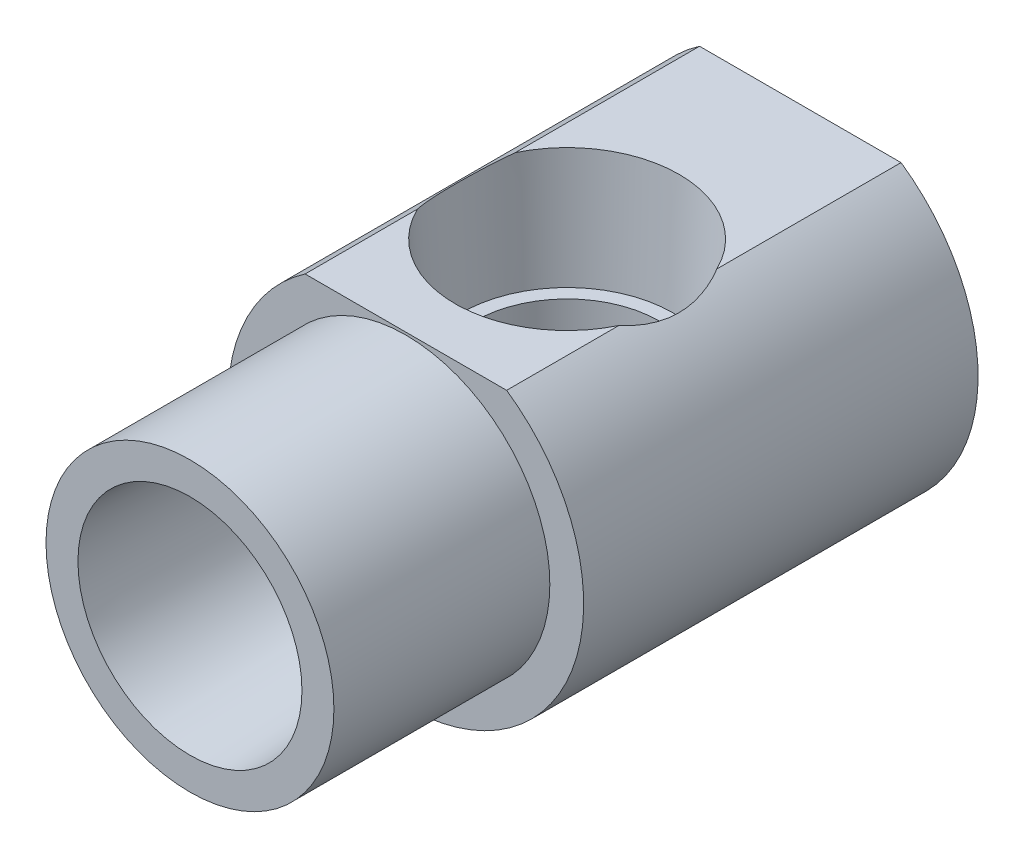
ISO-10303-21;
HEADER;
FILE_DESCRIPTION(('STEP AP214'),'2;1');
FILE_NAME('part.step','',(''),(''),'','','');
FILE_SCHEMA(('AUTOMOTIVE_DESIGN { 1 0 10303 214 1 1 1 1 }'));
ENDSEC;
DATA;
#1=APPLICATION_CONTEXT('core data for automotive mechanical design processes');
#2=APPLICATION_PROTOCOL_DEFINITION('international standard','automotive_design',2000,#1);
#3=PRODUCT_CONTEXT('',#1,'mechanical');
#4=PRODUCT('Part','Part','',(#3));
#5=PRODUCT_RELATED_PRODUCT_CATEGORY('part','',(#4));
#6=PRODUCT_DEFINITION_FORMATION('','',#4);
#7=PRODUCT_DEFINITION_CONTEXT('part definition',#1,'design');
#8=PRODUCT_DEFINITION('design','',#6,#7);
#9=PRODUCT_DEFINITION_SHAPE('','',#8);
#10=(LENGTH_UNIT() NAMED_UNIT(*) SI_UNIT(.MILLI.,.METRE.));
#11=(NAMED_UNIT(*) PLANE_ANGLE_UNIT() SI_UNIT($,.RADIAN.));
#12=(NAMED_UNIT(*) SI_UNIT($,.STERADIAN.) SOLID_ANGLE_UNIT());
#13=UNCERTAINTY_MEASURE_WITH_UNIT(LENGTH_MEASURE(1.E-05),#10,'distance_accuracy_value','');
#14=(GEOMETRIC_REPRESENTATION_CONTEXT(3) GLOBAL_UNCERTAINTY_ASSIGNED_CONTEXT((#13)) GLOBAL_UNIT_ASSIGNED_CONTEXT((#10,
#11,#12)) REPRESENTATION_CONTEXT('',''));
#15=CARTESIAN_POINT('',(0.,0.,0.));
#16=DIRECTION('',(0.,0.,1.));
#17=DIRECTION('',(1.,0.,0.));
#18=AXIS2_PLACEMENT_3D('',#15,#16,#17);
#19=CARTESIAN_POINT('',(-8.89,12.9217429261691,0.));
#20=DIRECTION('',(0.,-1.,0.));
#21=DIRECTION('',(0.,0.,-1.));
#22=AXIS2_PLACEMENT_3D('',#19,#20,#21);
#23=PLANE('',#22);
#24=DIRECTION('',(0.,0.,-1.));
#25=VECTOR('',#24,1.);
#26=CARTESIAN_POINT('',(8.89,12.9217429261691,0.));
#27=LINE('',#26,#25);
#28=CARTESIAN_POINT('',(8.89,12.9217429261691,-19.05));
#29=VERTEX_POINT('',#28);
#30=CARTESIAN_POINT('',(8.89,12.9217429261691,-28.9480549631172));
#31=VERTEX_POINT('',#30);
#32=EDGE_CURVE('E99',#29,#31,#27,.T.);
#33=ORIENTED_EDGE('',*,*,#32,.T.);
#34=CARTESIAN_POINT('',(0.,12.9217429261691,-33.274));
#35=DIRECTION('',(0.,-1.,0.));
#36=DIRECTION('',(0.,0.,-1.));
#37=AXIS2_PLACEMENT_3D('',#34,#35,#36);
#38=CIRCLE('',#37,9.88665264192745);
#39=CARTESIAN_POINT('',(-8.89,12.9217429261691,-28.9480549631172));
#40=VERTEX_POINT('',#39);
#41=EDGE_CURVE('E219',#31,#40,#38,.T.);
#42=ORIENTED_EDGE('',*,*,#41,.T.);
#43=DIRECTION('',(0.,0.,-1.));
#44=VECTOR('',#43,1.);
#45=CARTESIAN_POINT('',(-8.89,12.9217429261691,0.));
#46=LINE('',#45,#44);
#47=CARTESIAN_POINT('',(-8.89,12.9217429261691,-19.05));
#48=VERTEX_POINT('',#47);
#49=EDGE_CURVE('E115',#48,#40,#46,.T.);
#50=ORIENTED_EDGE('',*,*,#49,.F.);
#51=DIRECTION('',(1.,0.,0.));
#52=VECTOR('',#51,1.);
#53=CARTESIAN_POINT('',(-12.7,12.9217429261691,-19.05));
#54=LINE('',#53,#52);
#55=EDGE_CURVE('E104',#48,#29,#54,.T.);
#56=ORIENTED_EDGE('',*,*,#55,.T.);
#57=EDGE_LOOP('',(#33,#42,#50,#56));
#58=FACE_BOUND('',#57,.T.);
#59=ADVANCED_FACE('F16',(#58),#23,.F.);
#60=CARTESIAN_POINT('',(-8.73125000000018,0.,-17.0777962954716));
#61=DIRECTION('',(0.,0.,1.));
#62=DIRECTION('',(1.,0.,0.));
#63=AXIS2_PLACEMENT_3D('',#60,#61,#62);
#64=PLANE('',#63);
#65=CARTESIAN_POINT('',(0.,-1.53831558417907,-17.0777962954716));
#66=DIRECTION('',(0.,0.,1.));
#67=DIRECTION('',(0.,1.,0.));
#68=AXIS2_PLACEMENT_3D('',#65,#66,#67);
#69=ELLIPSE('',#68,7.0682508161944,6.80767250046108);
#70=CARTESIAN_POINT('',(0.,5.52993523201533,-17.0777962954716));
#71=VERTEX_POINT('',#70);
#72=EDGE_CURVE('E118',#71,#71,#69,.F.);
#73=ORIENTED_EDGE('',*,*,#72,.T.);
#74=EDGE_LOOP('',(#73));
#75=FACE_BOUND('',#74,.T.);
#76=CARTESIAN_POINT('',(0.,0.,-17.0777962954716));
#77=DIRECTION('',(0.,0.,1.));
#78=DIRECTION('',(1.,0.,0.));
#79=AXIS2_PLACEMENT_3D('',#76,#77,#78);
#80=CIRCLE('',#79,8.98559062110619);
#81=CARTESIAN_POINT('',(8.98559062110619,0.,-17.0777962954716));
#82=VERTEX_POINT('',#81);
#83=EDGE_CURVE('E217',#82,#82,#80,.T.);
#84=ORIENTED_EDGE('',*,*,#83,.T.);
#85=EDGE_LOOP('',(#84));
#86=FACE_BOUND('',#85,.T.);
#87=ADVANCED_FACE('F167',(#75,#86),#64,.T.);
#88=CARTESIAN_POINT('',(-8.73125000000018,0.,0.));
#89=DIRECTION('',(0.,0.,1.));
#90=DIRECTION('',(1.,0.,0.));
#91=AXIS2_PLACEMENT_3D('',#88,#89,#90);
#92=PLANE('',#91);
#93=CARTESIAN_POINT('',(0.,0.,0.));
#94=DIRECTION('',(0.,0.,1.));
#95=DIRECTION('',(1.,0.,0.));
#96=AXIS2_PLACEMENT_3D('',#93,#94,#95);
#97=CIRCLE('',#96,9.8806);
#98=CARTESIAN_POINT('',(9.8806,0.,0.));
#99=VERTEX_POINT('',#98);
#100=EDGE_CURVE('E222',#99,#99,#97,.T.);
#101=ORIENTED_EDGE('',*,*,#100,.F.);
#102=EDGE_LOOP('',(#101));
#103=FACE_BOUND('',#102,.T.);
#104=CARTESIAN_POINT('',(0.,0.,0.));
#105=DIRECTION('',(0.,0.,1.));
#106=DIRECTION('',(1.,0.,0.));
#107=AXIS2_PLACEMENT_3D('',#104,#105,#106);
#108=CIRCLE('',#107,12.7);
#109=CARTESIAN_POINT('',(12.7,0.,0.));
#110=VERTEX_POINT('',#109);
#111=EDGE_CURVE('E215',#110,#110,#108,.F.);
#112=ORIENTED_EDGE('',*,*,#111,.F.);
#113=EDGE_LOOP('',(#112));
#114=FACE_BOUND('',#113,.T.);
#115=ADVANCED_FACE('F171',(#103,#114),#92,.T.);
#116=CARTESIAN_POINT('',(-15.6845,0.,-53.848));
#117=DIRECTION('',(0.,0.,-1.));
#118=DIRECTION('',(-1.,0.,0.));
#119=AXIS2_PLACEMENT_3D('',#116,#117,#118);
#120=PLANE('',#119);
#121=DIRECTION('',(1.,0.,0.));
#122=VECTOR('',#121,1.);
#123=CARTESIAN_POINT('',(-3.66617420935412,6.35,-53.848));
#124=LINE('',#123,#122);
#125=CARTESIAN_POINT('',(-3.66617420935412,6.35,-53.848));
#126=VERTEX_POINT('',#125);
#127=CARTESIAN_POINT('',(3.66617420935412,6.35,-53.848));
#128=VERTEX_POINT('',#127);
#129=EDGE_CURVE('E121',#126,#128,#124,.T.);
#130=ORIENTED_EDGE('',*,*,#129,.F.);
#131=DIRECTION('',(0.5,0.866025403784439,0.));
#132=VECTOR('',#131,1.);
#133=CARTESIAN_POINT('',(-7.33234841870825,0.,-53.848));
#134=LINE('',#133,#132);
#135=CARTESIAN_POINT('',(-7.33234841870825,0.,-53.848));
#136=VERTEX_POINT('',#135);
#137=EDGE_CURVE('E274',#136,#126,#134,.T.);
#138=ORIENTED_EDGE('',*,*,#137,.F.);
#139=DIRECTION('',(-0.5,0.866025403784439,0.));
#140=VECTOR('',#139,1.);
#141=CARTESIAN_POINT('',(-3.66617420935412,-6.35,-53.848));
#142=LINE('',#141,#140);
#143=CARTESIAN_POINT('',(-3.66617420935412,-6.35,-53.848));
#144=VERTEX_POINT('',#143);
#145=EDGE_CURVE('E300',#144,#136,#142,.T.);
#146=ORIENTED_EDGE('',*,*,#145,.F.);
#147=DIRECTION('',(-1.,0.,0.));
#148=VECTOR('',#147,1.);
#149=CARTESIAN_POINT('',(3.66617420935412,-6.35,-53.848));
#150=LINE('',#149,#148);
#151=CARTESIAN_POINT('',(3.66617420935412,-6.35,-53.848));
#152=VERTEX_POINT('',#151);
#153=EDGE_CURVE('E297',#152,#144,#150,.T.);
#154=ORIENTED_EDGE('',*,*,#153,.F.);
#155=DIRECTION('',(-0.5,-0.866025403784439,0.));
#156=VECTOR('',#155,1.);
#157=CARTESIAN_POINT('',(7.33234841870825,0.,-53.848));
#158=LINE('',#157,#156);
#159=CARTESIAN_POINT('',(7.33234841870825,0.,-53.848));
#160=VERTEX_POINT('',#159);
#161=EDGE_CURVE('E294',#160,#152,#158,.T.);
#162=ORIENTED_EDGE('',*,*,#161,.F.);
#163=DIRECTION('',(0.5,-0.866025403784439,0.));
#164=VECTOR('',#163,1.);
#165=CARTESIAN_POINT('',(3.66617420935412,6.35,-53.848));
#166=LINE('',#165,#164);
#167=EDGE_CURVE('E291',#128,#160,#166,.T.);
#168=ORIENTED_EDGE('',*,*,#167,.F.);
#169=EDGE_LOOP('',(#130,#138,#146,#154,#162,#168));
#170=FACE_BOUND('',#169,.T.);
#171=DIRECTION('',(-1.,0.,0.));
#172=VECTOR('',#171,1.);
#173=CARTESIAN_POINT('',(-8.89,12.9217429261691,-53.848));
#174=LINE('',#173,#172);
#175=CARTESIAN_POINT('',(8.89,12.9217429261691,-53.848));
#176=VERTEX_POINT('',#175);
#177=CARTESIAN_POINT('',(-8.89,12.9217429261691,-53.848));
#178=VERTEX_POINT('',#177);
#179=EDGE_CURVE('E96',#176,#178,#174,.T.);
#180=ORIENTED_EDGE('',*,*,#179,.F.);
#181=CARTESIAN_POINT('',(0.,0.,-53.848));
#182=DIRECTION('',(0.,0.,-1.));
#183=DIRECTION('',(-1.,0.,0.));
#184=AXIS2_PLACEMENT_3D('',#181,#182,#183);
#185=CIRCLE('',#184,15.6845);
#186=EDGE_CURVE('E20',#176,#178,#185,.T.);
#187=ORIENTED_EDGE('',*,*,#186,.T.);
#188=EDGE_LOOP('',(#180,#187));
#189=FACE_BOUND('',#188,.T.);
#190=ADVANCED_FACE('F18',(#170,#189),#120,.T.);
#191=CARTESIAN_POINT('',(0.,0.,-75.1971669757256));
#192=DIRECTION('',(0.,0.,-1.));
#193=DIRECTION('',(-1.,0.,0.));
#194=AXIS2_PLACEMENT_3D('',#191,#192,#193);
#195=CYLINDRICAL_SURFACE('',#194,15.6845);
#196=CARTESIAN_POINT('',(6.18126199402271,14.4151149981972,-25.4578903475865));
#197=CARTESIAN_POINT('',(6.40820210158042,14.317827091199,-25.6438923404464));
#198=CARTESIAN_POINT('',(6.62617183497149,14.2179923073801,-25.8394298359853));
#199=CARTESIAN_POINT('',(7.04356392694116,14.015896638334,-26.248561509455));
#200=CARTESIAN_POINT('',(7.24297338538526,13.9136341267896,-26.4621680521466));
#201=CARTESIAN_POINT('',(7.62085258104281,13.7102837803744,-26.9044425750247));
#202=CARTESIAN_POINT('',(7.79947267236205,13.6091929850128,-27.1329809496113));
#203=CARTESIAN_POINT('',(8.13667540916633,13.4103063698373,-27.605534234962));
#204=CARTESIAN_POINT('',(8.29527210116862,13.3125082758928,-27.8495381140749));
#205=CARTESIAN_POINT('',(8.52405372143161,13.166366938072,-28.237604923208));
#206=CARTESIAN_POINT('',(8.6015950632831,13.1157948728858,-28.3765443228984));
#207=CARTESIAN_POINT('',(8.75042416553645,13.0169736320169,-28.6587897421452));
#208=CARTESIAN_POINT('',(8.82170394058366,12.9687274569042,-28.8021010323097));
#209=CARTESIAN_POINT('',(8.98942344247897,12.85334420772,-29.160530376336));
#210=CARTESIAN_POINT('',(9.082097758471,12.7878879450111,-29.377972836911));
#211=CARTESIAN_POINT('',(9.25265845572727,12.6650269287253,-29.8207919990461));
#212=CARTESIAN_POINT('',(9.33054529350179,12.6076219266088,-30.046168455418));
#213=CARTESIAN_POINT('',(9.47086217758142,12.5025600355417,-30.5041364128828));
#214=CARTESIAN_POINT('',(9.5332799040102,12.4549109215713,-30.7367334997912));
#215=CARTESIAN_POINT('',(9.64181076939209,12.3710847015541,-31.2076218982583));
#216=CARTESIAN_POINT('',(9.68793245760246,12.3349015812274,-31.445910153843));
#217=CARTESIAN_POINT('',(9.76349281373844,12.2751820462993,-31.9282043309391));
#218=CARTESIAN_POINT('',(9.79282896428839,12.2517233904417,-32.1722361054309));
#219=CARTESIAN_POINT('',(9.83390591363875,12.2187780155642,-32.662731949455));
#220=CARTESIAN_POINT('',(9.84564637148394,12.2092915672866,-32.9091960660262));
#221=CARTESIAN_POINT('',(9.85132494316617,12.2047101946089,-33.4024609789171));
#222=CARTESIAN_POINT('',(9.84526326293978,12.2096151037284,-33.6492617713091));
#223=CARTESIAN_POINT('',(9.81544491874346,12.233598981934,-34.1410778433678));
#224=CARTESIAN_POINT('',(9.79168936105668,12.2526770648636,-34.386093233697));
#225=CARTESIAN_POINT('',(9.7294701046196,12.3021291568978,-34.8530070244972));
#226=CARTESIAN_POINT('',(9.69232783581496,12.3314830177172,-35.0751929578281));
#227=CARTESIAN_POINT('',(9.60385268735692,12.400512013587,-35.5151815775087));
#228=CARTESIAN_POINT('',(9.55251354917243,12.4401917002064,-35.7329822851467));
#229=CARTESIAN_POINT('',(9.43631194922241,12.5285621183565,-36.1626605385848));
#230=CARTESIAN_POINT('',(9.37147123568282,12.5772383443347,-36.3745469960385));
#231=CARTESIAN_POINT('',(9.22879623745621,12.6822986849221,-36.7919366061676));
#232=CARTESIAN_POINT('',(9.15096192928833,12.7386828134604,-36.9974397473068));
#233=CARTESIAN_POINT('',(9.01061877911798,12.838109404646,-37.3347261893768));
#234=CARTESIAN_POINT('',(8.95152353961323,12.8794177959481,-37.4684665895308));
#235=CARTESIAN_POINT('',(8.76461266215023,13.0080031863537,-37.8679033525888));
#236=CARTESIAN_POINT('',(8.62838014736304,13.0990466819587,-38.1285210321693));
#237=CARTESIAN_POINT('',(8.33484719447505,13.2877507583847,-38.6351224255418));
#238=CARTESIAN_POINT('',(8.17753852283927,13.3854139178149,-38.8811003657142));
#239=CARTESIAN_POINT('',(7.8423843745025,13.5844995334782,-39.3580815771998));
#240=CARTESIAN_POINT('',(7.66448703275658,13.685931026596,-39.5890446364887));
#241=CARTESIAN_POINT('',(7.28939666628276,13.8893391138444,-40.034214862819));
#242=CARTESIAN_POINT('',(7.09221474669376,13.9913153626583,-40.2484315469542));
#243=CARTESIAN_POINT('',(6.68803601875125,14.1888008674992,-40.6503950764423));
#244=CARTESIAN_POINT('',(6.48182024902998,14.2844001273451,-40.8388823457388));
#245=CARTESIAN_POINT('',(6.05384699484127,14.4709681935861,-41.1977896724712));
#246=CARTESIAN_POINT('',(5.83215453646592,14.5619538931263,-41.3682785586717));
#247=CARTESIAN_POINT('',(5.60267382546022,14.6496957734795,-41.529590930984));
#248=B_SPLINE_CURVE_WITH_KNOTS('',3,(#196,#197,#198,#199,#200,#201,#202,#203,#204,#205,#206,
#207,#208,#209,#210,#211,#212,#213,#214,#215,#216,#217,#218,#219,#220,#221,#222,#223,#224,#225,
#226,#227,#228,#229,#230,#231,#232,#233,#234,#235,#236,#237,#238,#239,#240,#241,#242,#243,#244,
#245,#246,#247),.UNSPECIFIED.,.F.,.F.,(4,2,2,2,2,2,2,2,2,2,2,2,2,2,2,2,2,2,2,2,2,2,2,2,2,4),(0.,
0.927053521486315,1.85474664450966,2.77524763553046,3.69509925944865,4.19580328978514,
4.69713686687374,5.43222687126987,6.16729417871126,6.90294503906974,7.63820938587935,
8.37791768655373,9.11764032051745,9.85735439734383,10.5970222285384,11.2778067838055,
11.9588919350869,12.6388883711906,13.3188860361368,13.7745816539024,14.6967959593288,
15.6193715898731,16.5443240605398,17.4687469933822,18.3536130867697,19.2349623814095),.UNSPECIFIED.);
#249=CARTESIAN_POINT('',(8.89,12.9217429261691,-37.5999450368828));
#250=VERTEX_POINT('',#249);
#251=EDGE_CURVE('E35',#31,#250,#248,.T.);
#252=ORIENTED_EDGE('',*,*,#251,.F.);
#253=ORIENTED_EDGE('',*,*,#32,.F.);
#254=CARTESIAN_POINT('',(0.,0.,-19.05));
#255=DIRECTION('',(0.,0.,-1.));
#256=DIRECTION('',(-1.,0.,0.));
#257=AXIS2_PLACEMENT_3D('',#254,#255,#256);
#258=CIRCLE('',#257,15.6845);
#259=EDGE_CURVE('E105',#29,#48,#258,.T.);
#260=ORIENTED_EDGE('',*,*,#259,.T.);
#261=ORIENTED_EDGE('',*,*,#49,.T.);
#262=CARTESIAN_POINT('',(-5.60267382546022,14.6496957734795,-41.529590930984));
#263=CARTESIAN_POINT('',(-5.83916916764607,14.5592741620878,-41.3633464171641));
#264=CARTESIAN_POINT('',(-6.06739391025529,14.4654038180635,-41.1873565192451));
#265=CARTESIAN_POINT('',(-6.50657666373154,14.2732361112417,-40.8171061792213));
#266=CARTESIAN_POINT('',(-6.71753229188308,14.1749381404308,-40.6228432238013));
#267=CARTESIAN_POINT('',(-7.12045557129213,13.9768691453,-40.21824748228));
#268=CARTESIAN_POINT('',(-7.31250621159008,13.8771069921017,-40.0079928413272));
#269=CARTESIAN_POINT('',(-7.67797599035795,13.6782845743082,-39.5717033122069));
#270=CARTESIAN_POINT('',(-7.85140185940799,13.5792240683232,-39.3456741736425));
#271=CARTESIAN_POINT('',(-8.18139016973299,13.3830412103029,-38.8751731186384));
#272=CARTESIAN_POINT('',(-8.33766306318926,13.2859696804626,-38.6304767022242));
#273=CARTESIAN_POINT('',(-8.62954581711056,13.0982677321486,-38.1262921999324));
#274=CARTESIAN_POINT('',(-8.76513502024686,13.0076438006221,-37.8667896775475));
#275=CARTESIAN_POINT('',(-8.98947377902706,12.8533099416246,-37.387363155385));
#276=CARTESIAN_POINT('',(-9.0821738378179,12.7878343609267,-37.1698495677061));
#277=CARTESIAN_POINT('',(-9.25276992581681,12.6649454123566,-36.726898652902));
#278=CARTESIAN_POINT('',(-9.33066889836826,12.6075304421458,-36.501462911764));
#279=CARTESIAN_POINT('',(-9.47096094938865,12.5024850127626,-36.043506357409));
#280=CARTESIAN_POINT('',(-9.53335030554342,12.4548569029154,-35.81098385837));
#281=CARTESIAN_POINT('',(-9.64183755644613,12.3710636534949,-35.3402390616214));
#282=CARTESIAN_POINT('',(-9.68794342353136,12.3348929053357,-35.1020196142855));
#283=CARTESIAN_POINT('',(-9.76349062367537,12.2751837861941,-34.6198098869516));
#284=CARTESIAN_POINT('',(-9.79282550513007,12.2517261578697,-34.3757927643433));
#285=CARTESIAN_POINT('',(-9.83390185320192,12.2187812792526,-33.8853289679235));
#286=CARTESIAN_POINT('',(-9.84564316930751,12.2092941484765,-33.6388822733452));
#287=CARTESIAN_POINT('',(-9.85132631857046,12.2047090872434,-33.1456193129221));
#288=CARTESIAN_POINT('',(-9.84526600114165,12.2096128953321,-32.8988030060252));
#289=CARTESIAN_POINT('',(-9.81544809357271,12.2335964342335,-32.4069549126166));
#290=CARTESIAN_POINT('',(-9.79169153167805,12.2526753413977,-32.1619230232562));
#291=CARTESIAN_POINT('',(-9.72947134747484,12.3021281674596,-31.6950023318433));
#292=CARTESIAN_POINT('',(-9.69233092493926,12.3314805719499,-31.4728256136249));
#293=CARTESIAN_POINT('',(-9.60386128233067,12.4005053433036,-31.0328579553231));
#294=CARTESIAN_POINT('',(-9.55252598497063,12.4401821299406,-30.8150689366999));
#295=CARTESIAN_POINT('',(-9.43632738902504,12.5285504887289,-30.3853913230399));
#296=CARTESIAN_POINT('',(-9.37148448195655,12.5772284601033,-30.1734943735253));
#297=CARTESIAN_POINT('',(-9.22880457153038,12.6822926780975,-29.7560851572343));
#298=CARTESIAN_POINT('',(-9.1509674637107,12.7386789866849,-29.5505729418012));
#299=CARTESIAN_POINT('',(-9.01061796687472,12.8381099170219,-29.2132722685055));
#300=CARTESIAN_POINT('',(-8.95152097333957,12.8794194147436,-29.0795285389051));
#301=CARTESIAN_POINT('',(-8.80068775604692,12.9831855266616,-28.7571898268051));
#302=CARTESIAN_POINT('',(-8.70603543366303,13.0469462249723,-28.5703660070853));
#303=CARTESIAN_POINT('',(-8.50583150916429,13.1783430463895,-28.2038453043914));
#304=CARTESIAN_POINT('',(-8.40026939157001,13.2459828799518,-28.0241555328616));
#305=CARTESIAN_POINT('',(-8.14693598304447,13.403699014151,-27.6220187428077));
#306=CARTESIAN_POINT('',(-7.99573471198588,13.4946529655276,-27.402065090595));
#307=CARTESIAN_POINT('',(-7.67663330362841,13.6786987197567,-26.9754150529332));
#308=CARTESIAN_POINT('',(-7.50872479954,13.7717915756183,-26.7687253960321));
#309=CARTESIAN_POINT('',(-7.15655125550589,13.9580450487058,-26.3691064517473));
#310=CARTESIAN_POINT('',(-6.97225920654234,14.0512055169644,-26.176200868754));
#311=CARTESIAN_POINT('',(-6.5882203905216,14.2353204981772,-25.8055123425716));
#312=CARTESIAN_POINT('',(-6.38848080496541,14.3262760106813,-25.6277224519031));
#313=CARTESIAN_POINT('',(-6.18126199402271,14.4151149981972,-25.4578903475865));
#314=B_SPLINE_CURVE_WITH_KNOTS('',3,(#262,#263,#264,#265,#266,#267,#268,#269,#270,#271,#272,
#273,#274,#275,#276,#277,#278,#279,#280,#281,#282,#283,#284,#285,#286,#287,#288,#289,#290,#291,
#292,#293,#294,#295,#296,#297,#298,#299,#300,#301,#302,#303,#304,#305,#306,#307,#308,#309,#310,
#311,#312,#313),.UNSPECIFIED.,.F.,.F.,(4,2,2,2,2,2,2,2,2,2,2,2,2,2,2,2,2,2,2,2,2,2,2,2,2,4),(0.,
0.908274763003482,1.81667463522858,2.7208901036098,3.62477770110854,4.54212421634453,
5.46038099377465,6.19576092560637,6.93099446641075,7.66640429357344,8.40145356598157,
9.14111809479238,9.88078895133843,10.6205491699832,11.3602664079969,12.0410224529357,
12.7220704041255,13.4020975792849,14.0821302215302,14.5378258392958,15.1941212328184,
15.8510552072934,16.6961350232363,17.5416401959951,18.388566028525,19.2351004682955),.UNSPECIFIED.);
#315=CARTESIAN_POINT('',(-8.89,12.9217429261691,-37.5999450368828));
#316=VERTEX_POINT('',#315);
#317=EDGE_CURVE('E148',#316,#40,#314,.T.);
#318=ORIENTED_EDGE('',*,*,#317,.F.);
#319=EDGE_CURVE('E86',#316,#178,#46,.T.);
#320=ORIENTED_EDGE('',*,*,#319,.T.);
#321=ORIENTED_EDGE('',*,*,#186,.F.);
#322=EDGE_CURVE('E93',#250,#176,#27,.T.);
#323=ORIENTED_EDGE('',*,*,#322,.F.);
#324=EDGE_LOOP('',(#252,#253,#260,#261,#318,#320,#321,#323));
#325=FACE_BOUND('',#324,.T.);
#326=ADVANCED_FACE('F103',(#325),#195,.T.);
#327=CARTESIAN_POINT('',(-12.7,0.,-19.05));
#328=DIRECTION('',(0.,0.,1.));
#329=DIRECTION('',(1.,0.,0.));
#330=AXIS2_PLACEMENT_3D('',#327,#328,#329);
#331=PLANE('',#330);
#332=ORIENTED_EDGE('',*,*,#55,.F.);
#333=ORIENTED_EDGE('',*,*,#259,.F.);
#334=EDGE_LOOP('',(#332,#333));
#335=FACE_BOUND('',#334,.T.);
#336=CARTESIAN_POINT('',(0.,0.,-19.05));
#337=DIRECTION('',(0.,0.,-1.));
#338=DIRECTION('',(-1.,0.,0.));
#339=AXIS2_PLACEMENT_3D('',#336,#337,#338);
#340=CIRCLE('',#339,12.7);
#341=CARTESIAN_POINT('',(-12.7,0.,-19.05));
#342=VERTEX_POINT('',#341);
#343=EDGE_CURVE('E109',#342,#342,#340,.T.);
#344=ORIENTED_EDGE('',*,*,#343,.T.);
#345=EDGE_LOOP('',(#344));
#346=FACE_BOUND('',#345,.T.);
#347=ADVANCED_FACE('F165',(#335,#346),#331,.T.);
#348=CARTESIAN_POINT('',(0.,0.,-75.1971669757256));
#349=DIRECTION('',(0.,0.,-1.));
#350=DIRECTION('',(-1.,0.,0.));
#351=AXIS2_PLACEMENT_3D('',#348,#349,#350);
#352=CYLINDRICAL_SURFACE('',#351,12.7);
#353=ORIENTED_EDGE('',*,*,#343,.F.);
#354=EDGE_LOOP('',(#353));
#355=FACE_BOUND('',#354,.T.);
#356=ORIENTED_EDGE('',*,*,#111,.T.);
#357=EDGE_LOOP('',(#356));
#358=FACE_BOUND('',#357,.T.);
#359=ADVANCED_FACE('F199',(#355,#358),#352,.T.);
#360=ORIENTED_EDGE('',*,*,#319,.F.);
#361=EDGE_CURVE('E98',#316,#250,#38,.T.);
#362=ORIENTED_EDGE('',*,*,#361,.T.);
#363=ORIENTED_EDGE('',*,*,#322,.T.);
#364=ORIENTED_EDGE('',*,*,#179,.T.);
#365=EDGE_LOOP('',(#360,#362,#363,#364));
#366=FACE_BOUND('',#365,.T.);
#367=ADVANCED_FACE('F95',(#366),#23,.F.);
#368=CARTESIAN_POINT('',(-3.66617420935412,6.35,-50.8));
#369=DIRECTION('',(0.,1.,0.));
#370=DIRECTION('',(-1.,0.,0.));
#371=AXIS2_PLACEMENT_3D('',#368,#369,#370);
#372=PLANE('',#371);
#373=ORIENTED_EDGE('',*,*,#129,.T.);
#374=DIRECTION('',(0.,0.,-1.));
#375=VECTOR('',#374,1.);
#376=CARTESIAN_POINT('',(3.66617420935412,6.35,-50.8));
#377=LINE('',#376,#375);
#378=CARTESIAN_POINT('',(3.66617420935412,6.35,-47.498));
#379=VERTEX_POINT('',#378);
#380=EDGE_CURVE('E278',#379,#128,#377,.T.);
#381=ORIENTED_EDGE('',*,*,#380,.F.);
#382=DIRECTION('',(1.,0.,0.));
#383=VECTOR('',#382,1.);
#384=CARTESIAN_POINT('',(-3.66617420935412,6.35,-47.498));
#385=LINE('',#384,#383);
#386=CARTESIAN_POINT('',(-3.66617420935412,6.35,-47.498));
#387=VERTEX_POINT('',#386);
#388=EDGE_CURVE('E271',#387,#379,#385,.T.);
#389=ORIENTED_EDGE('',*,*,#388,.F.);
#390=DIRECTION('',(0.,0.,-1.));
#391=VECTOR('',#390,1.);
#392=CARTESIAN_POINT('',(-3.66617420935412,6.35,-50.8));
#393=LINE('',#392,#391);
#394=EDGE_CURVE('E102',#387,#126,#393,.T.);
#395=ORIENTED_EDGE('',*,*,#394,.T.);
#396=EDGE_LOOP('',(#373,#381,#389,#395));
#397=FACE_BOUND('',#396,.T.);
#398=ADVANCED_FACE('F198',(#397),#372,.F.);
#399=CARTESIAN_POINT('',(-7.33234841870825,0.,-50.8));
#400=DIRECTION('',(-0.866025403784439,0.5,0.));
#401=DIRECTION('',(-0.5,-0.866025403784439,0.));
#402=AXIS2_PLACEMENT_3D('',#399,#400,#401);
#403=PLANE('',#402);
#404=ORIENTED_EDGE('',*,*,#137,.T.);
#405=ORIENTED_EDGE('',*,*,#394,.F.);
#406=DIRECTION('',(0.5,0.866025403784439,0.));
#407=VECTOR('',#406,1.);
#408=CARTESIAN_POINT('',(-7.33234841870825,0.,-47.498));
#409=LINE('',#408,#407);
#410=CARTESIAN_POINT('',(-7.33234841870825,0.,-47.498));
#411=VERTEX_POINT('',#410);
#412=EDGE_CURVE('E275',#411,#387,#409,.T.);
#413=ORIENTED_EDGE('',*,*,#412,.F.);
#414=DIRECTION('',(0.,0.,-1.));
#415=VECTOR('',#414,1.);
#416=CARTESIAN_POINT('',(-7.33234841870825,0.,-50.8));
#417=LINE('',#416,#415);
#418=EDGE_CURVE('E309',#411,#136,#417,.T.);
#419=ORIENTED_EDGE('',*,*,#418,.T.);
#420=EDGE_LOOP('',(#404,#405,#413,#419));
#421=FACE_BOUND('',#420,.T.);
#422=ADVANCED_FACE('F204',(#421),#403,.F.);
#423=CARTESIAN_POINT('',(-3.66617420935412,-6.35,-50.8));
#424=DIRECTION('',(-0.866025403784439,-0.5,0.));
#425=DIRECTION('',(0.5,-0.866025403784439,0.));
#426=AXIS2_PLACEMENT_3D('',#423,#424,#425);
#427=PLANE('',#426);
#428=ORIENTED_EDGE('',*,*,#145,.T.);
#429=ORIENTED_EDGE('',*,*,#418,.F.);
#430=DIRECTION('',(-0.5,0.866025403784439,0.));
#431=VECTOR('',#430,1.);
#432=CARTESIAN_POINT('',(-3.66617420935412,-6.35,-47.498));
#433=LINE('',#432,#431);
#434=CARTESIAN_POINT('',(-3.66617420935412,-6.35,-47.498));
#435=VERTEX_POINT('',#434);
#436=EDGE_CURVE('E279',#435,#411,#433,.T.);
#437=ORIENTED_EDGE('',*,*,#436,.F.);
#438=DIRECTION('',(0.,0.,-1.));
#439=VECTOR('',#438,1.);
#440=CARTESIAN_POINT('',(-3.66617420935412,-6.35,-50.8));
#441=LINE('',#440,#439);
#442=EDGE_CURVE('E501',#435,#144,#441,.T.);
#443=ORIENTED_EDGE('',*,*,#442,.T.);
#444=EDGE_LOOP('',(#428,#429,#437,#443));
#445=FACE_BOUND('',#444,.T.);
#446=ADVANCED_FACE('F417',(#445),#427,.F.);
#447=CARTESIAN_POINT('',(3.66617420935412,-6.35,-50.8));
#448=DIRECTION('',(0.,-1.,0.));
#449=DIRECTION('',(1.,0.,0.));
#450=AXIS2_PLACEMENT_3D('',#447,#448,#449);
#451=PLANE('',#450);
#452=ORIENTED_EDGE('',*,*,#153,.T.);
#453=ORIENTED_EDGE('',*,*,#442,.F.);
#454=DIRECTION('',(-1.,0.,0.));
#455=VECTOR('',#454,1.);
#456=CARTESIAN_POINT('',(3.66617420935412,-6.35,-47.498));
#457=LINE('',#456,#455);
#458=CARTESIAN_POINT('',(3.66617420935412,-6.35,-47.498));
#459=VERTEX_POINT('',#458);
#460=EDGE_CURVE('E282',#459,#435,#457,.T.);
#461=ORIENTED_EDGE('',*,*,#460,.F.);
#462=DIRECTION('',(0.,0.,-1.));
#463=VECTOR('',#462,1.);
#464=CARTESIAN_POINT('',(3.66617420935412,-6.35,-50.8));
#465=LINE('',#464,#463);
#466=EDGE_CURVE('E318',#459,#152,#465,.T.);
#467=ORIENTED_EDGE('',*,*,#466,.T.);
#468=EDGE_LOOP('',(#452,#453,#461,#467));
#469=FACE_BOUND('',#468,.T.);
#470=ADVANCED_FACE('F407',(#469),#451,.F.);
#471=CARTESIAN_POINT('',(7.33234841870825,0.,-50.8));
#472=DIRECTION('',(0.866025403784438,-0.5,0.));
#473=DIRECTION('',(0.5,0.866025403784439,0.));
#474=AXIS2_PLACEMENT_3D('',#471,#472,#473);
#475=PLANE('',#474);
#476=ORIENTED_EDGE('',*,*,#161,.T.);
#477=ORIENTED_EDGE('',*,*,#466,.F.);
#478=DIRECTION('',(-0.5,-0.866025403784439,0.));
#479=VECTOR('',#478,1.);
#480=CARTESIAN_POINT('',(7.33234841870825,0.,-47.498));
#481=LINE('',#480,#479);
#482=CARTESIAN_POINT('',(7.33234841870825,0.,-47.498));
#483=VERTEX_POINT('',#482);
#484=EDGE_CURVE('E285',#483,#459,#481,.T.);
#485=ORIENTED_EDGE('',*,*,#484,.F.);
#486=DIRECTION('',(0.,0.,-1.));
#487=VECTOR('',#486,1.);
#488=CARTESIAN_POINT('',(7.33234841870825,0.,-50.8));
#489=LINE('',#488,#487);
#490=EDGE_CURVE('E316',#483,#160,#489,.T.);
#491=ORIENTED_EDGE('',*,*,#490,.T.);
#492=EDGE_LOOP('',(#476,#477,#485,#491));
#493=FACE_BOUND('',#492,.T.);
#494=ADVANCED_FACE('F186',(#493),#475,.F.);
#495=CARTESIAN_POINT('',(3.66617420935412,6.35,-50.8));
#496=DIRECTION('',(0.866025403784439,0.5,0.));
#497=DIRECTION('',(-0.5,0.866025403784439,0.));
#498=AXIS2_PLACEMENT_3D('',#495,#496,#497);
#499=PLANE('',#498);
#500=ORIENTED_EDGE('',*,*,#167,.T.);
#501=ORIENTED_EDGE('',*,*,#490,.F.);
#502=DIRECTION('',(0.5,-0.866025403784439,0.));
#503=VECTOR('',#502,1.);
#504=CARTESIAN_POINT('',(3.66617420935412,6.35,-47.498));
#505=LINE('',#504,#503);
#506=EDGE_CURVE('E273',#379,#483,#505,.T.);
#507=ORIENTED_EDGE('',*,*,#506,.F.);
#508=ORIENTED_EDGE('',*,*,#380,.T.);
#509=EDGE_LOOP('',(#500,#501,#507,#508));
#510=FACE_BOUND('',#509,.T.);
#511=ADVANCED_FACE('F178',(#510),#499,.F.);
#512=CARTESIAN_POINT('',(0.,0.,-47.498));
#513=DIRECTION('',(0.,0.,-1.));
#514=DIRECTION('',(-1.,0.,0.));
#515=AXIS2_PLACEMENT_3D('',#512,#513,#514);
#516=PLANE('',#515);
#517=ORIENTED_EDGE('',*,*,#388,.T.);
#518=ORIENTED_EDGE('',*,*,#506,.T.);
#519=ORIENTED_EDGE('',*,*,#484,.T.);
#520=ORIENTED_EDGE('',*,*,#460,.T.);
#521=ORIENTED_EDGE('',*,*,#436,.T.);
#522=ORIENTED_EDGE('',*,*,#412,.T.);
#523=EDGE_LOOP('',(#517,#518,#519,#520,#521,#522));
#524=FACE_BOUND('',#523,.T.);
#525=ADVANCED_FACE('F175',(#524),#516,.T.);
#526=CARTESIAN_POINT('',(0.,-6.16022605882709,-32.9348809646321));
#527=DIRECTION('',(0.,0.267292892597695,0.963615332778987));
#528=DIRECTION('',(0.,-0.963615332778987,0.267292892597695));
#529=AXIS2_PLACEMENT_3D('',#526,#527,#528);
#530=CONICAL_SURFACE('',#529,4.92936747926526,0.794181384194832);
#531=CARTESIAN_POINT('',(-4.92956747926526,-6.70529941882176,-32.7494241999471));
#532=CARTESIAN_POINT('',(-4.86454849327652,-6.74578087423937,-32.8010709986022));
#533=CARTESIAN_POINT('',(-4.79934438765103,-6.78602416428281,-32.8526711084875));
#534=CARTESIAN_POINT('',(-4.66853190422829,-6.86595614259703,-32.955790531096));
#535=CARTESIAN_POINT('',(-4.6029235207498,-6.90564482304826,-33.0073098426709));
#536=CARTESIAN_POINT('',(-4.40534693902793,-7.0238176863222,-33.1618389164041));
#537=CARTESIAN_POINT('',(-4.27272274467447,-7.10134897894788,-33.2647439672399));
#538=CARTESIAN_POINT('',(-4.00251092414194,-7.25460162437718,-33.4727581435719));
#539=CARTESIAN_POINT('',(-3.86487828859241,-7.33024565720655,-33.5778659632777));
#540=CARTESIAN_POINT('',(-3.58724919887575,-7.47631067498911,-33.7885271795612));
#541=CARTESIAN_POINT('',(-3.4472535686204,-7.54673343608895,-33.8940804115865));
#542=CARTESIAN_POINT('',(-3.21819876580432,-7.6544961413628,-34.0666952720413));
#543=CARTESIAN_POINT('',(-3.12989166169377,-7.69427803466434,-34.1332226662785));
#544=CARTESIAN_POINT('',(-2.95246158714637,-7.76968051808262,-34.2675218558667));
#545=CARTESIAN_POINT('',(-2.86333881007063,-7.80530206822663,-34.3352933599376));
#546=CARTESIAN_POINT('',(-2.68510954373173,-7.87069033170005,-34.4725920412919));
#547=CARTESIAN_POINT('',(-2.59600565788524,-7.90048815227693,-34.5421075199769));
#548=CARTESIAN_POINT('',(-2.41819352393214,-7.95229207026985,-34.6845042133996));
#549=CARTESIAN_POINT('',(-2.32948506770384,-7.97430290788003,-34.7573833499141));
#550=CARTESIAN_POINT('',(-2.18125639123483,-8.0025802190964,-34.8847777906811));
#551=CARTESIAN_POINT('',(-2.12117975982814,-8.01160947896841,-34.93801645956));
#552=CARTESIAN_POINT('',(-2.00293406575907,-8.02367996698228,-35.0472285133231));
#553=CARTESIAN_POINT('',(-1.94476433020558,-8.02672333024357,-35.1032009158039));
#554=CARTESIAN_POINT('',(-1.83159633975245,-8.02621720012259,-35.2176935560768));
#555=CARTESIAN_POINT('',(-1.77658330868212,-8.0227015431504,-35.276199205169));
#556=CARTESIAN_POINT('',(-1.6701866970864,-8.00916225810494,-35.3956932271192));
#557=CARTESIAN_POINT('',(-1.61880314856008,-7.99913857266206,-35.4566816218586));
#558=CARTESIAN_POINT('',(-1.50977573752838,-7.97060670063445,-35.5932146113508));
#559=CARTESIAN_POINT('',(-1.45300970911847,-7.95077990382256,-35.6691789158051));
#560=CARTESIAN_POINT('',(-1.34440201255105,-7.9045561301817,-35.8226384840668));
#561=CARTESIAN_POINT('',(-1.29256550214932,-7.87815237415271,-35.9001352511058));
#562=CARTESIAN_POINT('',(-1.19160520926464,-7.82024221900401,-36.056916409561));
#563=CARTESIAN_POINT('',(-1.14254008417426,-7.78865902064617,-36.1362092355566));
#564=CARTESIAN_POINT('',(-1.04637994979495,-7.72237338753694,-36.29448783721));
#565=CARTESIAN_POINT('',(-0.999282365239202,-7.6876752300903,-36.3734738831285));
#566=CARTESIAN_POINT('',(-0.905327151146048,-7.61651127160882,-36.5302968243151));
#567=CARTESIAN_POINT('',(-0.858469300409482,-7.58005286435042,-36.6081369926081));
#568=CARTESIAN_POINT('',(-0.762530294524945,-7.50612620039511,-36.7625501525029));
#569=CARTESIAN_POINT('',(-0.713440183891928,-7.4686541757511,-36.839115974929));
#570=CARTESIAN_POINT('',(-0.636553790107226,-7.41316517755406,-36.9507753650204));
#571=CARTESIAN_POINT('',(-0.610675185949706,-7.39497859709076,-36.98709331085));
#572=CARTESIAN_POINT('',(-0.557166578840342,-7.35895068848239,-37.0585834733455));
#573=CARTESIAN_POINT('',(-0.529537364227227,-7.34110920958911,-37.0937561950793));
#574=CARTESIAN_POINT('',(-0.472002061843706,-7.30624531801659,-37.1621240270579));
#575=CARTESIAN_POINT('',(-0.442114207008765,-7.28921784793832,-37.1953317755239));
#576=CARTESIAN_POINT('',(-0.378876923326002,-7.25646188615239,-37.2589387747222));
#577=CARTESIAN_POINT('',(-0.345537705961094,-7.24072979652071,-37.2893458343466));
#578=CARTESIAN_POINT('',(-0.298590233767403,-7.2217446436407,-37.3259206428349));
#579=CARTESIAN_POINT('',(-0.287212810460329,-7.21736140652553,-37.3343553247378));
#580=CARTESIAN_POINT('',(-0.263920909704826,-7.20889912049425,-37.3506238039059));
#581=CARTESIAN_POINT('',(-0.252006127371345,-7.20482024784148,-37.3584572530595));
#582=CARTESIAN_POINT('',(-0.215431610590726,-7.19316114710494,-37.3808293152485));
#583=CARTESIAN_POINT('',(-0.189883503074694,-7.18613396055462,-37.3942867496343));
#584=CARTESIAN_POINT('',(-0.143911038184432,-7.17602735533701,-37.413620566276));
#585=CARTESIAN_POINT('',(-0.124064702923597,-7.17239348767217,-37.4205646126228));
#586=CARTESIAN_POINT('',(-0.0833496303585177,-7.16666514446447,-37.4315060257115));
#587=CARTESIAN_POINT('',(-0.0624819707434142,-7.16456908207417,-37.4355064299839));
#588=CARTESIAN_POINT('',(-0.0201025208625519,-7.16218209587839,-37.440061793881));
#589=CARTESIAN_POINT('',(0.00141281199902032,-7.16190420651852,-37.4405918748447));
#590=CARTESIAN_POINT('',(0.0441684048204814,-7.16323101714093,-37.438060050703));
#591=CARTESIAN_POINT('',(0.0654085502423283,-7.16483647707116,-37.4349966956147));
#592=CARTESIAN_POINT('',(0.110198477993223,-7.17008198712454,-37.4249806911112));
#593=CARTESIAN_POINT('',(0.133592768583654,-7.17399996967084,-37.4174966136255));
#594=CARTESIAN_POINT('',(0.17873468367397,-7.18350548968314,-37.3993166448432));
#595=CARTESIAN_POINT('',(0.200478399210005,-7.18909684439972,-37.3886134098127));
#596=CARTESIAN_POINT('',(0.2398629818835,-7.20073247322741,-37.366305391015));
#597=CARTESIAN_POINT('',(0.257687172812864,-7.20664892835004,-37.3549492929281));
#598=CARTESIAN_POINT('',(0.292180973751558,-7.21915234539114,-37.3309127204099));
#599=CARTESIAN_POINT('',(0.308849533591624,-7.22573990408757,-37.3182310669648));
#600=CARTESIAN_POINT('',(0.341213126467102,-7.23941653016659,-37.2918562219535));
#601=CARTESIAN_POINT('',(0.356905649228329,-7.24650679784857,-37.2781606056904));
#602=CARTESIAN_POINT('',(0.387415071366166,-7.26104267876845,-37.2500286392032));
#603=CARTESIAN_POINT('',(0.402232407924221,-7.26848811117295,-37.2355926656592));
#604=CARTESIAN_POINT('',(0.445150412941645,-7.29098927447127,-37.1918725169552));
#605=CARTESIAN_POINT('',(0.472204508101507,-7.30642610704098,-37.1617596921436));
#606=CARTESIAN_POINT('',(0.524288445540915,-7.33787585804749,-37.100105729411));
#607=CARTESIAN_POINT('',(0.549316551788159,-7.35388925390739,-37.0685634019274));
#608=CARTESIAN_POINT('',(0.597944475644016,-7.38626125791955,-37.0044323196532));
#609=CARTESIAN_POINT('',(0.621540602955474,-7.40262062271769,-36.9718411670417));
#610=CARTESIAN_POINT('',(0.667647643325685,-7.43546985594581,-36.905961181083));
#611=CARTESIAN_POINT('',(0.690158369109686,-7.45195974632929,-36.8726722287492));
#612=CARTESIAN_POINT('',(0.756929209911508,-7.50170827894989,-36.7714653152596));
#613=CARTESIAN_POINT('',(0.800015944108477,-7.53495851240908,-36.7027736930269));
#614=CARTESIAN_POINT('',(0.884912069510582,-7.60055008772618,-36.5643545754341));
#615=CARTESIAN_POINT('',(0.926723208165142,-7.63289266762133,-36.494628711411));
#616=CARTESIAN_POINT('',(1.01820852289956,-7.70171107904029,-36.3418036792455));
#617=CARTESIAN_POINT('',(1.06792659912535,-7.73786554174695,-36.25858379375));
#618=CARTESIAN_POINT('',(1.16983424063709,-7.80643496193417,-36.0919919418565));
#619=CARTESIAN_POINT('',(1.22202530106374,-7.83884761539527,-36.0086199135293));
#620=CARTESIAN_POINT('',(1.3300168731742,-7.89746710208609,-35.8439498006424));
#621=CARTESIAN_POINT('',(1.38574898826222,-7.92376225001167,-35.762639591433));
#622=CARTESIAN_POINT('',(1.50302343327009,-7.96843195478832,-35.6020644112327));
#623=CARTESIAN_POINT('',(1.56455968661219,-7.98681468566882,-35.5227974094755));
#624=CARTESIAN_POINT('',(1.68274005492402,-8.0113305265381,-35.381030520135));
#625=CARTESIAN_POINT('',(1.73840719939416,-8.01902598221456,-35.3179903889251));
#626=CARTESIAN_POINT('',(1.85342088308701,-8.0271237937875,-35.1948696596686));
#627=CARTESIAN_POINT('',(1.91276752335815,-8.02752594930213,-35.1347891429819));
#628=CARTESIAN_POINT('',(2.03541341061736,-8.02131936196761,-35.0164430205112));
#629=CARTESIAN_POINT('',(2.09877111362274,-8.01455501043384,-34.9582471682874));
#630=CARTESIAN_POINT('',(2.22705927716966,-7.99476920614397,-34.8447606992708));
#631=CARTESIAN_POINT('',(2.29199008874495,-7.98174634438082,-34.789470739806));
#632=CARTESIAN_POINT('',(2.47290620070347,-7.93863392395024,-34.6393754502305));
#633=CARTESIAN_POINT('',(2.5896031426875,-7.90313058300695,-34.5470205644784));
#634=CARTESIAN_POINT('',(2.8225077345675,-7.82171920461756,-34.3662734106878));
#635=CARTESIAN_POINT('',(2.93871435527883,-7.77579524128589,-34.2778874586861));
#636=CARTESIAN_POINT('',(3.17037156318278,-7.67676905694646,-34.1026268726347));
#637=CARTESIAN_POINT('',(3.28581352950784,-7.6236257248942,-34.0157643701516));
#638=CARTESIAN_POINT('',(3.51496782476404,-7.51258701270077,-33.8430158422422));
#639=CARTESIAN_POINT('',(3.62868121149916,-7.45469468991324,-33.7571292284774));
#640=CARTESIAN_POINT('',(3.84346248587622,-7.34132392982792,-33.5940730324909));
#641=CARTESIAN_POINT('',(3.94467760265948,-7.28616486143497,-33.5168739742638));
#642=CARTESIAN_POINT('',(4.14594860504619,-7.17370528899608,-33.3624841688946));
#643=CARTESIAN_POINT('',(4.24600427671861,-7.11640439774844,-33.28529342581));
#644=CARTESIAN_POINT('',(4.44384293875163,-7.00085162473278,-33.1317451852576));
#645=CARTESIAN_POINT('',(4.54163876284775,-6.94261988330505,-33.0553890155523));
#646=CARTESIAN_POINT('',(4.73628082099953,-6.82485933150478,-32.902533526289));
#647=CARTESIAN_POINT('',(4.83312730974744,-6.7653308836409,-32.8260342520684));
#648=CARTESIAN_POINT('',(4.92956747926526,-6.70529941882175,-32.7494241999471));
#649=B_SPLINE_CURVE_WITH_KNOTS('',3,(#531,#532,#533,#534,#535,#536,#537,#538,#539,#540,#541,
#542,#543,#544,#545,#546,#547,#548,#549,#550,#551,#552,#553,#554,#555,#556,#557,#558,#559,#560,
#561,#562,#563,#564,#565,#566,#567,#568,#569,#570,#571,#572,#573,#574,#575,#576,#577,#578,#579,
#580,#581,#582,#583,#584,#585,#586,#587,#588,#589,#590,#591,#592,#593,#594,#595,#596,#597,#598,
#599,#600,#601,#602,#603,#604,#605,#606,#607,#608,#609,#610,#611,#612,#613,#614,#615,#616,#617,
#618,#619,#620,#621,#622,#623,#624,#625,#626,#627,#628,#629,#630,#631,#632,#633,#634,#635,#636,
#637,#638,#639,#640,#641,#642,#643,#644,#645,#646,#647,#648),.UNSPECIFIED.,.F.,.F.,(4,2,2,2,2,2,
2,2,2,2,2,2,2,2,2,2,2,2,2,2,2,2,2,2,2,2,2,2,2,2,2,2,2,2,2,2,2,2,2,2,2,2,2,2,2,2,2,2,2,2,2,2,2,2,
2,2,2,2,4),(0.,0.277131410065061,0.554266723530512,1.10894454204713,1.67582273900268,
2.24250720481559,2.59495486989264,2.94732104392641,3.29775028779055,3.64796584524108,
3.89006351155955,4.13207480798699,4.37284107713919,4.61360946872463,4.90376471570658,
5.19422028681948,5.48945424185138,5.78428882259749,6.07797756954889,6.37297155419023,
6.51742442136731,6.66181269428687,6.80513942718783,6.94805360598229,6.99250734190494,
7.03698662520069,7.12571030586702,7.18949790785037,7.25321959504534,7.31739760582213,
7.38160152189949,7.45580479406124,7.53017864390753,7.59592329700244,7.66172693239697,
7.72769335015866,7.79362653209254,7.92347126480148,8.05342610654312,8.18370275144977,
8.31400179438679,8.57686868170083,8.83935762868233,9.14969866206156,9.46022978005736,
9.76595294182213,10.0713595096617,10.3242750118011,10.5771974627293,10.8357264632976,
11.0943136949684,11.5525549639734,12.0115013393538,12.4731802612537,12.9345642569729,
13.3507361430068,13.7669836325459,14.178151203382,14.5892052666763),.UNSPECIFIED.);
#650=CARTESIAN_POINT('',(-4.89410839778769,-6.72734191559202,-32.7775712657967));
#651=VERTEX_POINT('',#650);
#652=CARTESIAN_POINT('',(4.89410839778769,-6.72734191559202,-32.7775712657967));
#653=VERTEX_POINT('',#652);
#654=EDGE_CURVE('E248',#651,#653,#649,.T.);
#655=ORIENTED_EDGE('',*,*,#654,.F.);
#656=CARTESIAN_POINT('',(0.,-6.16022605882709,-32.9348809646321));
#657=DIRECTION('',(0.,-0.267292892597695,-0.963615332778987));
#658=DIRECTION('',(0.,0.963615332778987,-0.267292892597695));
#659=AXIS2_PLACEMENT_3D('',#656,#657,#658);
#660=CIRCLE('',#659,4.92936747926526);
#661=EDGE_CURVE('E122',#653,#651,#660,.T.);
#662=ORIENTED_EDGE('',*,*,#661,.F.);
#663=EDGE_LOOP('',(#655,#662));
#664=FACE_BOUND('',#663,.T.);
#665=CARTESIAN_POINT('',(0.,-7.45486660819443,-37.6021785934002));
#666=VERTEX_POINT('',#665);
#667=VERTEX_LOOP('',#666);
#668=FACE_BOUND('',#667,.T.);
#669=ADVANCED_FACE('F177',(#664,#668),#530,.F.);
#670=CARTESIAN_POINT('',(0.,-0.374711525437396,-12.0775717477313));
#671=DIRECTION('',(0.,0.267292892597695,0.963615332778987));
#672=DIRECTION('',(0.,-0.963615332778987,0.267292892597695));
#673=AXIS2_PLACEMENT_3D('',#670,#671,#672);
#674=CONICAL_SURFACE('',#673,7.39548661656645,0.113446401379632);
#675=CARTESIAN_POINT('',(4.76098088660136,-6.76122891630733,-34.2526658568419));
#676=CARTESIAN_POINT('',(4.77116683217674,-6.76832025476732,-34.1422369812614));
#677=CARTESIAN_POINT('',(4.78112654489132,-6.77336535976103,-34.0316489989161));
#678=CARTESIAN_POINT('',(4.80084554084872,-6.77917532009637,-33.8103362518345));
#679=CARTESIAN_POINT('',(4.81060481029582,-6.77993988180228,-33.6996114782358));
#680=CARTESIAN_POINT('',(4.83015809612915,-6.77700228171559,-33.4783974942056));
#681=CARTESIAN_POINT('',(4.83995203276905,-6.77330720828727,-33.3679081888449));
#682=CARTESIAN_POINT('',(4.85978391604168,-6.76142678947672,-33.1472034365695));
#683=CARTESIAN_POINT('',(4.86982185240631,-6.75324163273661,-33.0369879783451));
#684=CARTESIAN_POINT('',(4.90026789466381,-6.72230572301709,-32.7099605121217));
#685=CARTESIAN_POINT('',(4.92126224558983,-6.69313187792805,-32.4937827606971));
#686=CARTESIAN_POINT('',(4.96531856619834,-6.61929257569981,-32.0643476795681));
#687=CARTESIAN_POINT('',(4.98838084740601,-6.57462478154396,-31.8510907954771));
#688=CARTESIAN_POINT('',(5.03316421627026,-6.47936742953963,-31.456225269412));
#689=CARTESIAN_POINT('',(5.05465210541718,-6.4303690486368,-31.2741987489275));
#690=CARTESIAN_POINT('',(5.09871537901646,-6.32458689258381,-30.9125374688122));
#691=CARTESIAN_POINT('',(5.12129098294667,-6.26780154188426,-30.7329032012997));
#692=CARTESIAN_POINT('',(5.1672036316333,-6.14793098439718,-30.3755222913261));
#693=CARTESIAN_POINT('',(5.19054190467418,-6.08483524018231,-30.1977793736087));
#694=CARTESIAN_POINT('',(5.23760452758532,-5.95372472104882,-29.8441948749));
#695=CARTESIAN_POINT('',(5.26132885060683,-5.8857102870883,-29.6683531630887));
#696=CARTESIAN_POINT('',(5.30951176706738,-5.74392399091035,-29.3136114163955));
#697=CARTESIAN_POINT('',(5.33397315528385,-5.67004730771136,-29.1347538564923));
#698=CARTESIAN_POINT('',(5.38276331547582,-5.51902669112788,-28.7784008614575));
#699=CARTESIAN_POINT('',(5.40709208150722,-5.44188261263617,-28.6009054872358));
#700=CARTESIAN_POINT('',(5.45531585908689,-5.28534639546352,-28.2478439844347));
#701=CARTESIAN_POINT('',(5.47921234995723,-5.2059662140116,-28.0722727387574));
#702=CARTESIAN_POINT('',(5.52655057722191,-5.04510152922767,-27.7220667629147));
#703=CARTESIAN_POINT('',(5.54999238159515,-4.96361734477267,-27.5474318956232));
#704=CARTESIAN_POINT('',(5.57314297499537,-4.88130922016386,-27.3731540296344));
#705=B_SPLINE_CURVE_WITH_KNOTS('',3,(#675,#676,#677,#678,#679,#680,#681,#682,#683,#684,#685,
#686,#687,#688,#689,#690,#691,#692,#693,#694,#695,#696,#697,#698,#699,#700,#701,#702,#703,#704),
.UNSPECIFIED.,.F.,.F.,(4,2,2,2,2,2,2,2,2,2,2,2,2,2,4),(0.,0.333363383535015,0.666749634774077,
0.999606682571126,1.33244974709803,1.98917542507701,2.646000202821,3.21497186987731,
3.78405882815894,4.35411246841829,4.92412663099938,5.5092494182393,6.09439821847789,
6.67685854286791,7.25923110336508),.UNSPECIFIED.);
#706=CARTESIAN_POINT('',(5.57308671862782,-4.88150922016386,-27.3735773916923));
#707=VERTEX_POINT('',#706);
#708=EDGE_CURVE('E11',#653,#707,#705,.T.);
#709=ORIENTED_EDGE('',*,*,#708,.F.);
#710=ORIENTED_EDGE('',*,*,#661,.T.);
#711=CARTESIAN_POINT('',(-5.57314297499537,-4.88130922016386,-27.3731540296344));
#712=CARTESIAN_POINT('',(-5.54864798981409,-4.96839763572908,-27.5575641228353));
#713=CARTESIAN_POINT('',(-5.52382511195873,-5.05456937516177,-27.7423720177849));
#714=CARTESIAN_POINT('',(-5.47367787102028,-5.22453041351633,-28.1130546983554));
#715=CARTESIAN_POINT('',(-5.44835341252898,-5.30831925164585,-28.2989296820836));
#716=CARTESIAN_POINT('',(-5.39720632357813,-5.47344975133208,-28.6731215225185));
#717=CARTESIAN_POINT('',(-5.37138156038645,-5.55477268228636,-28.861446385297));
#718=CARTESIAN_POINT('',(-5.31962582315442,-5.71359939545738,-29.2396795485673));
#719=CARTESIAN_POINT('',(-5.29369485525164,-5.79110339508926,-29.4295877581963));
#720=CARTESIAN_POINT('',(-5.24277644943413,-5.93906110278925,-29.805846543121));
#721=CARTESIAN_POINT('',(-5.21778339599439,-6.00965380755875,-29.9921413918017));
#722=CARTESIAN_POINT('',(-5.16833391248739,-6.14495538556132,-30.3669635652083));
#723=CARTESIAN_POINT('',(-5.14387753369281,-6.20966369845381,-30.5554911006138));
#724=CARTESIAN_POINT('',(-5.0959765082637,-6.33139627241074,-30.9346420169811));
#725=CARTESIAN_POINT('',(-5.07252951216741,-6.38843911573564,-31.1252590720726));
#726=CARTESIAN_POINT('',(-5.0270098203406,-6.49303667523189,-31.5092164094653));
#727=CARTESIAN_POINT('',(-5.00493671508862,-6.54059422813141,-31.7025558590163));
#728=CARTESIAN_POINT('',(-4.96280295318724,-6.62342077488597,-32.0888184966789));
#729=CARTESIAN_POINT('',(-4.94271568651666,-6.6588747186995,-32.2816985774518));
#730=CARTESIAN_POINT('',(-4.90415121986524,-6.71669386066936,-32.6696488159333));
#731=CARTESIAN_POINT('',(-4.88567425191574,-6.73905717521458,-32.8647192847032));
#732=CARTESIAN_POINT('',(-4.85867174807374,-6.76210080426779,-33.1594515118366));
#733=CARTESIAN_POINT('',(-4.84973521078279,-6.76803526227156,-33.2586883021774));
#734=CARTESIAN_POINT('',(-4.83201463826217,-6.77627351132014,-33.4573335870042));
#735=CARTESIAN_POINT('',(-4.82323060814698,-6.77857718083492,-33.5567420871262));
#736=CARTESIAN_POINT('',(-4.80565778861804,-6.77960294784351,-33.7556541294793));
#737=CARTESIAN_POINT('',(-4.79686900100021,-6.77832218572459,-33.8551576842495));
#738=CARTESIAN_POINT('',(-4.77910860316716,-6.7723195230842,-34.0540385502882));
#739=CARTESIAN_POINT('',(-4.77013700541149,-6.76759785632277,-34.1534158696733));
#740=CARTESIAN_POINT('',(-4.76098088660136,-6.76122891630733,-34.2526658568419));
#741=B_SPLINE_CURVE_WITH_KNOTS('',3,(#711,#712,#713,#714,#715,#716,#717,#718,#719,#720,#721,
#722,#723,#724,#725,#726,#727,#728,#729,#730,#731,#732,#733,#734,#735,#736,#737,#738,#739,#740),
.UNSPECIFIED.,.F.,.F.,(4,2,2,2,2,2,2,2,2,2,2,2,2,2,4),(0.,0.616225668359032,1.23256969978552,
1.8527945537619,2.47298405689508,3.07525601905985,3.67758527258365,4.27842698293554,
4.87908873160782,5.47011155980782,6.06121940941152,6.36060783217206,6.66000627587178,
6.95964364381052,7.25926065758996),.UNSPECIFIED.);
#742=CARTESIAN_POINT('',(-5.57308671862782,-4.88150922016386,-27.3735773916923));
#743=VERTEX_POINT('',#742);
#744=EDGE_CURVE('E26',#743,#651,#741,.T.);
#745=ORIENTED_EDGE('',*,*,#744,.F.);
#746=CARTESIAN_POINT('',(5.57307308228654,-4.88170922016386,-27.3735645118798));
#747=CARTESIAN_POINT('',(5.58380220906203,-4.72471397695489,-27.3837622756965));
#748=CARTESIAN_POINT('',(5.58865914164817,-4.56705989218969,-27.3883414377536));
#749=CARTESIAN_POINT('',(5.58729946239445,-4.25213639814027,-27.3870174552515));
#750=CARTESIAN_POINT('',(5.58110451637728,-4.09486684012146,-27.3811348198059));
#751=CARTESIAN_POINT('',(5.55847097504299,-3.78347175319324,-27.3597914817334));
#752=CARTESIAN_POINT('',(5.54214321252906,-3.62933060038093,-27.3444344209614));
#753=CARTESIAN_POINT('',(5.5000370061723,-3.3233585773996,-27.3053562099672));
#754=CARTESIAN_POINT('',(5.47425293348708,-3.17152913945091,-27.2816300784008));
#755=CARTESIAN_POINT('',(5.40518682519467,-2.82774362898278,-27.219168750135));
#756=CARTESIAN_POINT('',(5.35900554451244,-2.63679719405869,-27.1780796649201));
#757=CARTESIAN_POINT('',(5.25312186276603,-2.26100534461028,-27.0866031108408));
#758=CARTESIAN_POINT('',(5.19341643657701,-2.07616130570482,-27.0362135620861));
#759=CARTESIAN_POINT('',(5.06084072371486,-1.71218123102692,-26.9281724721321));
#760=CARTESIAN_POINT('',(4.98789692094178,-1.53308399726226,-26.8704809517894));
#761=CARTESIAN_POINT('',(4.82949435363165,-1.18226502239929,-26.7501852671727));
#762=CARTESIAN_POINT('',(4.7440366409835,-1.01054266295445,-26.687581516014));
#763=CARTESIAN_POINT('',(4.55845239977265,-0.670873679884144,-26.5577557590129));
#764=CARTESIAN_POINT('',(4.45801514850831,-0.503125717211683,-26.4904577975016));
#765=CARTESIAN_POINT('',(4.24399604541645,-0.176744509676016,-26.3545450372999));
#766=CARTESIAN_POINT('',(4.13041222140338,-0.0181126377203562,-26.2859300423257));
#767=CARTESIAN_POINT('',(3.89017340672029,0.288460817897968,-26.1494041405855));
#768=CARTESIAN_POINT('',(3.76355762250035,0.43643231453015,-26.0814917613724));
#769=CARTESIAN_POINT('',(3.49672100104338,0.720602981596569,-25.9480550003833));
#770=CARTESIAN_POINT('',(3.35650635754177,0.856807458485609,-25.8825295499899));
#771=CARTESIAN_POINT('',(3.00734741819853,1.16370601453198,-25.7322174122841));
#772=CARTESIAN_POINT('',(2.79221632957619,1.32842462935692,-25.649314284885));
#773=CARTESIAN_POINT('',(2.33601195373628,1.625211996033,-25.4974388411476));
#774=CARTESIAN_POINT('',(2.09497086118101,1.75732060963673,-25.4284495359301));
#775=CARTESIAN_POINT('',(1.63295562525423,1.96142805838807,-25.3207636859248));
#776=CARTESIAN_POINT('',(1.41558141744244,2.03983861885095,-25.278906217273));
#777=CARTESIAN_POINT('',(0.969010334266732,2.16345453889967,-25.2126043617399));
#778=CARTESIAN_POINT('',(0.739822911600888,2.2086860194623,-25.1881462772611));
#779=CARTESIAN_POINT('',(0.274823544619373,2.26253954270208,-25.1590011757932));
#780=CARTESIAN_POINT('',(0.0389869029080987,2.27099973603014,-25.154401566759));
#781=CARTESIAN_POINT('',(-0.430497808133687,2.25010965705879,-25.1657258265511));
#782=CARTESIAN_POINT('',(-0.664145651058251,2.22075551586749,-25.1816517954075));
#783=CARTESIAN_POINT('',(-1.10663722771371,2.12989754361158,-25.2306214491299));
#784=CARTESIAN_POINT('',(-1.31609613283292,2.07066749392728,-25.2624531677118));
#785=CARTESIAN_POINT('',(-1.72260445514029,1.92521663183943,-25.3399070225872));
#786=CARTESIAN_POINT('',(-1.91964828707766,1.83898377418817,-25.3855353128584));
#787=CARTESIAN_POINT('',(-2.38300360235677,1.60033652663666,-25.510249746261));
#788=CARTESIAN_POINT('',(-2.64139610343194,1.43552053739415,-25.5952075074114));
#789=CARTESIAN_POINT('',(-3.00393709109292,1.161144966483,-25.7329451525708));
#790=CARTESIAN_POINT('',(-3.12076165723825,1.06500084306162,-25.7806517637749));
#791=CARTESIAN_POINT('',(-3.34618058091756,0.864667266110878,-25.8785676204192));
#792=CARTESIAN_POINT('',(-3.45477680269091,0.760479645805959,-25.9287762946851));
#793=CARTESIAN_POINT('',(-3.70119269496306,0.506483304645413,-26.0490153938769));
#794=CARTESIAN_POINT('',(-3.83559032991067,0.353674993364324,-26.1197183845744));
#795=CARTESIAN_POINT('',(-4.08982799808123,0.0367162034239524,-26.2619527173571));
#796=CARTESIAN_POINT('',(-4.20966258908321,-0.127438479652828,-26.3334843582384));
#797=CARTESIAN_POINT('',(-4.43540467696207,-0.466274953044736,-26.4755221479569));
#798=CARTESIAN_POINT('',(-4.54126855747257,-0.640987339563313,-26.5460245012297));
#799=CARTESIAN_POINT('',(-4.73876559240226,-0.999515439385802,-26.6836386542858));
#800=CARTESIAN_POINT('',(-4.83040060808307,-1.18332995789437,-26.7507508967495));
#801=CARTESIAN_POINT('',(-5.00106462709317,-1.56328059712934,-26.8806154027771));
#802=CARTESIAN_POINT('',(-5.07979286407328,-1.7595931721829,-26.9432484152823));
#803=CARTESIAN_POINT('',(-5.22175052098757,-2.16037424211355,-27.0598189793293));
#804=CARTESIAN_POINT('',(-5.28497466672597,-2.36484548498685,-27.1137535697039));
#805=CARTESIAN_POINT('',(-5.39444351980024,-2.77951823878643,-27.2093882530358));
#806=CARTESIAN_POINT('',(-5.44080511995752,-2.9896690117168,-27.2511721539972));
#807=CARTESIAN_POINT('',(-5.51558786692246,-3.41541226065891,-27.3195751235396));
#808=CARTESIAN_POINT('',(-5.54403124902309,-3.63099764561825,-27.3462129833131));
#809=CARTESIAN_POINT('',(-5.57721638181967,-4.01922503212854,-27.377447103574));
#810=CARTESIAN_POINT('',(-5.58571066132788,-4.19125609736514,-27.3855246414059));
#811=CARTESIAN_POINT('',(-5.5885853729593,-4.44986380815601,-27.3882553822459));
#812=CARTESIAN_POINT('',(-5.58788567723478,-4.53636586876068,-27.3875885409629));
#813=CARTESIAN_POINT('',(-5.58306826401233,-4.70921745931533,-27.3830213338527));
#814=CARTESIAN_POINT('',(-5.57894938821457,-4.79556692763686,-27.3791198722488));
#815=CARTESIAN_POINT('',(-5.57307308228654,-4.88170922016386,-27.3735645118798));
#816=B_SPLINE_CURVE_WITH_KNOTS('',3,(#746,#747,#748,#749,#750,#751,#752,#753,#754,#755,#756,
#757,#758,#759,#760,#761,#762,#763,#764,#765,#766,#767,#768,#769,#770,#771,#772,#773,#774,#775,
#776,#777,#778,#779,#780,#781,#782,#783,#784,#785,#786,#787,#788,#789,#790,#791,#792,#793,#794,
#795,#796,#797,#798,#799,#800,#801,#802,#803,#804,#805,#806,#807,#808,#809,#810,#811,#812,#813,
#814,#815),.UNSPECIFIED.,.F.,.F.,(4,2,2,2,2,2,2,2,2,2,2,2,2,2,2,2,2,2,2,2,2,2,2,2,2,2,2,2,2,2,2,
2,2,2,4),(0.,0.472711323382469,0.944496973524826,1.41121103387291,1.87820335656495,
2.47942025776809,3.08077177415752,3.68557104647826,4.29031950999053,4.9100365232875,
5.52984662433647,6.14784371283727,6.76556063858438,7.61267108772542,8.45874086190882,
9.16036218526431,9.86143054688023,10.5655815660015,11.2698046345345,11.9270793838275,
12.5846477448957,13.5331119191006,14.0087351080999,14.4842502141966,15.1296651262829,
15.7753204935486,16.4229461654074,17.0704870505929,17.7314540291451,18.392645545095,
19.0491620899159,19.7048623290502,20.2212077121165,20.4806146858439,20.7401095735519),.UNSPECIFIED.);
#817=EDGE_CURVE('E239',#707,#743,#816,.T.);
#818=ORIENTED_EDGE('',*,*,#817,.F.);
#819=EDGE_LOOP('',(#709,#710,#745,#818));
#820=FACE_BOUND('',#819,.T.);
#821=CARTESIAN_POINT('',(0.,2.60934292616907,14.702704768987));
#822=DIRECTION('',(0.,-1.,0.));
#823=DIRECTION('',(0.,0.,1.));
#824=AXIS2_PLACEMENT_3D('',#821,#822,#823);
#825=ELLIPSE('',#824,39.0080434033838,9.50641500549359);
#826=CARTESIAN_POINT('',(-1.18168220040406,2.60934292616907,-24.0028009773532));
#827=VERTEX_POINT('',#826);
#828=CARTESIAN_POINT('',(1.18168220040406,2.60934292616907,-24.0028009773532));
#829=VERTEX_POINT('',#828);
#830=EDGE_CURVE('E130',#827,#829,#825,.T.);
#831=ORIENTED_EDGE('',*,*,#830,.F.);
#832=CARTESIAN_POINT('',(1.98428488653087,2.31708369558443,-24.1565416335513));
#833=CARTESIAN_POINT('',(1.87956701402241,2.36586844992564,-24.1311251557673));
#834=CARTESIAN_POINT('',(1.77280064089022,2.41121842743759,-24.1073752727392));
#835=CARTESIAN_POINT('',(1.55557788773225,2.49448648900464,-24.0636017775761));
#836=CARTESIAN_POINT('',(1.44511880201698,2.53239897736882,-24.0435809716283));
#837=CARTESIAN_POINT('',(1.22127583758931,2.60009438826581,-24.0077300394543));
#838=CARTESIAN_POINT('',(1.10789752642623,2.62989168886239,-23.991892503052));
#839=CARTESIAN_POINT('',(0.878724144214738,2.68092224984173,-23.964714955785));
#840=CARTESIAN_POINT('',(0.762929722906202,2.70215778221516,-23.9533737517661));
#841=CARTESIAN_POINT('',(0.529069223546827,2.73575870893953,-23.9354082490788));
#842=CARTESIAN_POINT('',(0.410994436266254,2.74807716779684,-23.9288089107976));
#843=CARTESIAN_POINT('',(0.174027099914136,2.76341445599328,-23.9205899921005));
#844=CARTESIAN_POINT('',(0.0551342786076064,2.76643002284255,-23.9189721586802));
#845=CARTESIAN_POINT('',(-0.182430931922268,2.76308504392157,-23.9207657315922));
#846=CARTESIAN_POINT('',(-0.301103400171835,2.75672905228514,-23.9241746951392));
#847=CARTESIAN_POINT('',(-0.537358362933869,2.73479502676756,-23.9359211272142));
#848=CARTESIAN_POINT('',(-0.654940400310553,2.71921328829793,-23.944260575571));
#849=CARTESIAN_POINT('',(-0.982800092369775,2.66280247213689,-23.9743872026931));
#850=CARTESIAN_POINT('',(-1.19094996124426,2.61174623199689,-24.0015954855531));
#851=CARTESIAN_POINT('',(-1.49495613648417,2.51542867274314,-24.0525411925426));
#852=CARTESIAN_POINT('',(-1.59499147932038,2.48000100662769,-24.0712292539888));
#853=CARTESIAN_POINT('',(-1.79198682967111,2.4030239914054,-24.1116663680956));
#854=CARTESIAN_POINT('',(-1.8889483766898,2.3614777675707,-24.1334138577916));
#855=CARTESIAN_POINT('',(-1.98428488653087,2.31708369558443,-24.1565416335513));
#856=B_SPLINE_CURVE_WITH_KNOTS('',3,(#832,#833,#834,#835,#836,#837,#838,#839,#840,#841,#842,
#843,#844,#845,#846,#847,#848,#849,#850,#851,#852,#853,#854,#855),.UNSPECIFIED.,.F.,.F.,(4,2,2,
2,2,2,2,2,2,2,2,4),(0.,0.35484005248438,0.709946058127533,1.06441875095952,1.41879731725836,
1.77502787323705,2.13138334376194,2.4875656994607,2.84389117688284,3.48907935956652,
3.8121434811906,4.13504315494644),.UNSPECIFIED.);
#857=EDGE_CURVE('E106',#829,#827,#856,.T.);
#858=ORIENTED_EDGE('',*,*,#857,.F.);
#859=EDGE_LOOP('',(#831,#858));
#860=FACE_BOUND('',#859,.T.);
#861=ORIENTED_EDGE('',*,*,#72,.F.);
#862=EDGE_LOOP('',(#861));
#863=FACE_BOUND('',#862,.T.);
#864=ADVANCED_FACE('F132',(#820,#860,#863),#674,.F.);
#865=CARTESIAN_POINT('',(0.,-9.56745567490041,-33.274));
#866=DIRECTION('',(0.,1.,0.));
#867=DIRECTION('',(0.,0.,1.));
#868=AXIS2_PLACEMENT_3D('',#865,#866,#867);
#869=CONICAL_SURFACE('',#868,0.,1.0471975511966);
#870=ORIENTED_EDGE('',*,*,#708,.T.);
#871=CARTESIAN_POINT('',(0.,-4.88150922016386,-33.274));
#872=DIRECTION('',(0.,-1.,0.));
#873=DIRECTION('',(0.,0.,-1.));
#874=AXIS2_PLACEMENT_3D('',#871,#872,#873);
#875=CIRCLE('',#874,8.116297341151);
#876=EDGE_CURVE('E155',#743,#707,#875,.T.);
#877=ORIENTED_EDGE('',*,*,#876,.F.);
#878=ORIENTED_EDGE('',*,*,#744,.T.);
#879=ORIENTED_EDGE('',*,*,#654,.T.);
#880=EDGE_LOOP('',(#870,#877,#878,#879));
#881=FACE_BOUND('',#880,.T.);
#882=ADVANCED_FACE('F245',(#881),#869,.F.);
#883=CARTESIAN_POINT('',(0.,12.9217429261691,-33.274));
#884=DIRECTION('',(0.,-1.,0.));
#885=DIRECTION('',(0.,0.,-1.));
#886=AXIS2_PLACEMENT_3D('',#883,#884,#885);
#887=CYLINDRICAL_SURFACE('',#886,8.116297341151);
#888=ORIENTED_EDGE('',*,*,#817,.T.);
#889=ORIENTED_EDGE('',*,*,#876,.T.);
#890=EDGE_LOOP('',(#888,#889));
#891=FACE_BOUND('',#890,.T.);
#892=CARTESIAN_POINT('',(0.,2.60934292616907,-33.274));
#893=DIRECTION('',(0.,-1.,0.));
#894=DIRECTION('',(0.,0.,-1.));
#895=AXIS2_PLACEMENT_3D('',#892,#893,#894);
#896=CIRCLE('',#895,8.116297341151);
#897=CARTESIAN_POINT('',(0.,2.60934292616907,-41.390297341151));
#898=VERTEX_POINT('',#897);
#899=EDGE_CURVE('E228',#898,#898,#896,.T.);
#900=ORIENTED_EDGE('',*,*,#899,.F.);
#901=EDGE_LOOP('',(#900));
#902=FACE_BOUND('',#901,.T.);
#903=ADVANCED_FACE('F235',(#891,#902),#887,.F.);
#904=CARTESIAN_POINT('',(0.,2.60934292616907,-42.6202026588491));
#905=DIRECTION('',(0.,-1.,0.));
#906=DIRECTION('',(0.,0.,-1.));
#907=AXIS2_PLACEMENT_3D('',#904,#905,#906);
#908=PLANE('',#907);
#909=ORIENTED_EDGE('',*,*,#830,.T.);
#910=CARTESIAN_POINT('',(0.,2.60934292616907,-33.274));
#911=DIRECTION('',(0.,-1.,0.));
#912=DIRECTION('',(0.,0.,-1.));
#913=AXIS2_PLACEMENT_3D('',#910,#911,#912);
#914=CIRCLE('',#913,9.3462026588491);
#915=EDGE_CURVE('E226',#827,#829,#914,.T.);
#916=ORIENTED_EDGE('',*,*,#915,.F.);
#917=EDGE_LOOP('',(#909,#916));
#918=FACE_BOUND('',#917,.T.);
#919=ORIENTED_EDGE('',*,*,#899,.T.);
#920=EDGE_LOOP('',(#919));
#921=FACE_BOUND('',#920,.T.);
#922=ADVANCED_FACE('F142',(#918,#921),#908,.F.);
#923=CARTESIAN_POINT('',(0.,2.60934292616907,-33.274));
#924=DIRECTION('',(0.,1.,0.));
#925=DIRECTION('',(0.,0.,1.));
#926=AXIS2_PLACEMENT_3D('',#923,#924,#925);
#927=CONICAL_SURFACE('',#926,9.3462026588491,0.0523598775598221);
#928=ORIENTED_EDGE('',*,*,#251,.T.);
#929=ORIENTED_EDGE('',*,*,#361,.F.);
#930=ORIENTED_EDGE('',*,*,#317,.T.);
#931=ORIENTED_EDGE('',*,*,#41,.F.);
#932=EDGE_LOOP('',(#928,#929,#930,#931));
#933=FACE_BOUND('',#932,.T.);
#934=ORIENTED_EDGE('',*,*,#857,.T.);
#935=ORIENTED_EDGE('',*,*,#915,.T.);
#936=EDGE_LOOP('',(#934,#935));
#937=FACE_BOUND('',#936,.T.);
#938=ADVANCED_FACE('F136',(#933,#937),#927,.F.);
#939=CARTESIAN_POINT('',(0.,0.,-17.0777962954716));
#940=DIRECTION('',(0.,0.,1.));
#941=DIRECTION('',(1.,0.,0.));
#942=AXIS2_PLACEMENT_3D('',#939,#940,#941);
#943=CONICAL_SURFACE('',#942,8.98559062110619,0.05235987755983);
#944=ORIENTED_EDGE('',*,*,#100,.T.);
#945=EDGE_LOOP('',(#944));
#946=FACE_BOUND('',#945,.T.);
#947=ORIENTED_EDGE('',*,*,#83,.F.);
#948=EDGE_LOOP('',(#947));
#949=FACE_BOUND('',#948,.T.);
#950=ADVANCED_FACE('F141',(#946,#949),#943,.F.);
#951=CLOSED_SHELL('',(#59,#87,#115,#190,#326,#347,#359,#367,#398,#422,#446,#470,#494,#511,#525,
#669,#864,#882,#903,#922,#938,#950));
#952=MANIFOLD_SOLID_BREP('B1',#951);
#953=ADVANCED_BREP_SHAPE_REPRESENTATION('',(#18,#952),#14);
#954=SHAPE_DEFINITION_REPRESENTATION(#9,#953);
ENDSEC;
END-ISO-10303-21;
